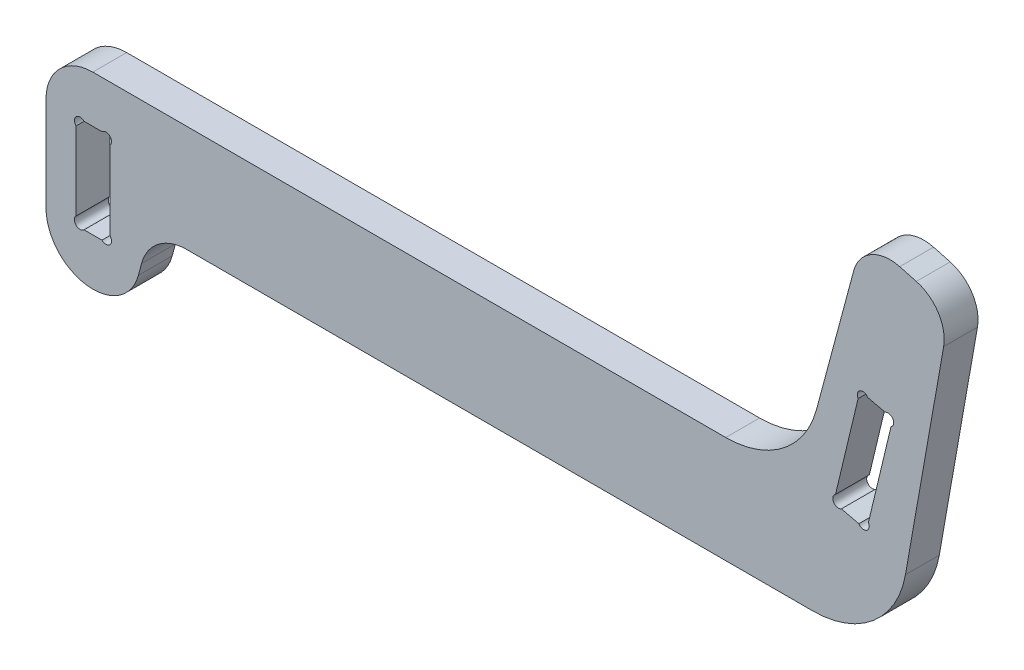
from build123d import *

# Parameters (mm, degrees)
BOSS_EXTRU_1_DEPTH      = 18
ESQUISSE2_W             = 18
ESQUISSE2_H             = 50
ENL_V_MAT_EXTRU_1_DEPTH = 510.448875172
ESQUISSE3_R             = 3
ENL_V_MAT_EXTRU_2_DEPTH = 510.448875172
ESQUISSE4_R             = 3
ENL_V_MAT_EXTRU_3_DEPTH = 510.448875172


with BuildPart() as part:
    # Esquisse1 → Boss.-Extru.1 (new body)
    with BuildSketch(Plane.XY):
        with BuildLine():
            Line((74.9, -6.75419933), (407.994327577, -6.75419933))
            ThreePointArc((407.994327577, -6.75419933), (440.133708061, 4.943578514), (457.234715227, 34.563391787))
            Line((457.234715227, 34.563391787), (477.55938187, 149.83030421))
            ThreePointArc((477.55938187, 149.83030421), (474.731055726, 164.04925993), (463.039607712, 172.621784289))
            Line((463.039607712, 172.621784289), (454.196815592, 174.991203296))
            ThreePointArc((454.196815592, 174.991203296), (439.02043469, 172.993194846), (429.701918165, 160.849067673))
            Line((429.701918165, 160.849067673), (409.929941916, 87.059047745))
            ThreePointArc((409.929941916, 87.059047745), (392.071722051, 60.332332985), (361.633650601, 50))
            Line((361.633650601, 50), (24.9, 50))
            ThreePointArc((24.9, 50), (7.293041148, 42.706958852), (0, 25.1))
            Line((0, 25.1), (0, 0))
            Line((0, 0), (0, -25.1))
            ThreePointArc((0, -25.1), (7.293041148, -42.706958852), (24.9, -50))
            Line((24.9, -50), (25.1, -50))
            ThreePointArc((25.1, -50), (40.258976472, -44.853871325), (49.152085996, -31.542605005))
            Line((49.152085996, -31.542605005), (50.847914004, -25.211594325))
            ThreePointArc((50.847914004, -25.211594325), (59.741023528, -11.900328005), (74.9, -6.75419933))
        make_face()
        Polygon((433.026376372, 107.240833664), (435.089359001, 106.746766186), (437.15234163, 106.252698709), (450.531364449, 103.048532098), (436.557025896, 44.698571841), (419.052037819, 48.890873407), align=None, mode=Mode.SUBTRACT)
    extrude(amount=BOSS_EXTRU_1_DEPTH)

    # Esquisse2 → Enl_v. mat.-Extru.1 (cut, through all)
    with BuildSketch(Plane.XY.offset(18)):
        with Locations((25, 0)):
            Rectangle(ESQUISSE2_W, ESQUISSE2_H)
    extrude(amount=-ENL_V_MAT_EXTRU_1_DEPTH, mode=Mode.SUBTRACT)

    # Esquisse3 → Enl_v. mat.-Extru.2 (cut, through all)
    with BuildSketch(Plane.XY.offset(18)):
        with Locations((18.121320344, 22.878679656)):
            Circle(ESQUISSE3_R)
        with Locations((31.878679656, -22.878679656)):
            Circle(ESQUISSE3_R)
        with Locations((31.878679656, 22.878679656)):
            Circle(ESQUISSE3_R)
        with Locations((18.121320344, -22.878679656)):
            Circle(ESQUISSE3_R)
    extrude(amount=-ENL_V_MAT_EXTRU_2_DEPTH, mode=Mode.SUBTRACT)

    # Esquisse4 → Enl_v. mat.-Extru.3 (cut, through all)
    with BuildSketch(Plane.XY.offset(18)):
        with Locations((434.595291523, 104.683783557)):
            Circle(ESQUISSE4_R)
        with Locations((434.988110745, 47.255621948)):
            Circle(ESQUISSE4_R)
        with Locations((447.974314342, 101.479616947)):
            Circle(ESQUISSE4_R)
        with Locations((421.609087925, 50.459788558)):
            Circle(ESQUISSE4_R)
    extrude(amount=-ENL_V_MAT_EXTRU_3_DEPTH, mode=Mode.SUBTRACT)


solid = part.part
